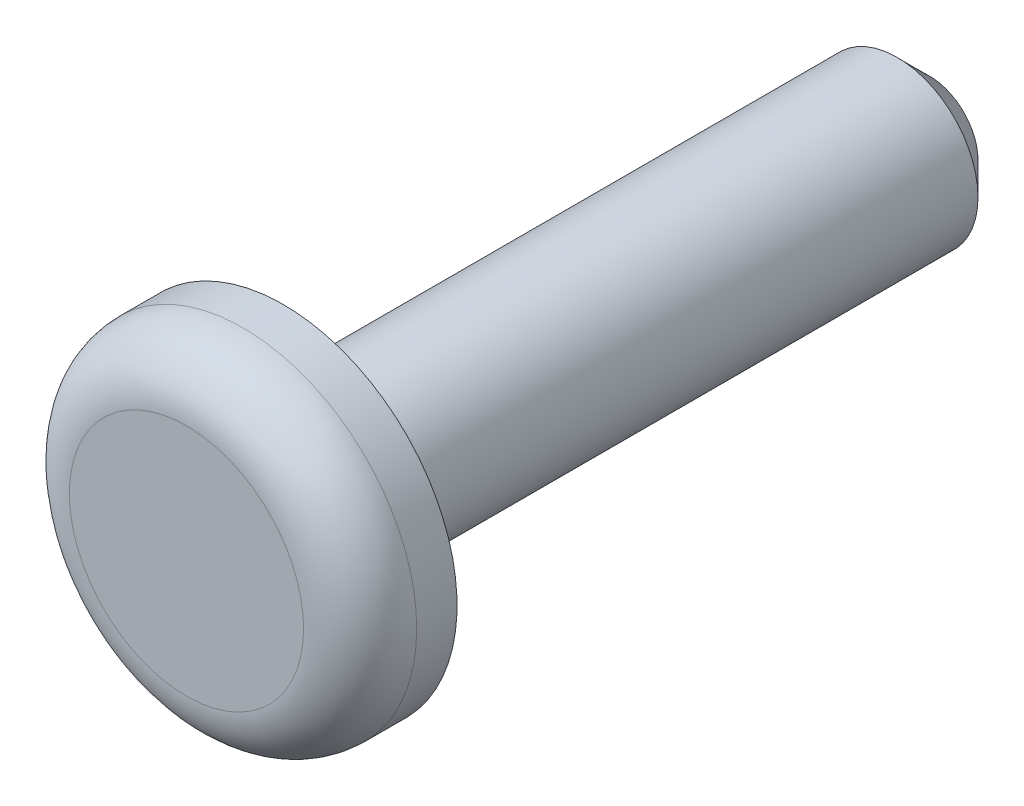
ISO-10303-21;
HEADER;
FILE_DESCRIPTION(('STEP AP214'),'2;1');
FILE_NAME('part.step','',(''),(''),'','','');
FILE_SCHEMA(('AUTOMOTIVE_DESIGN { 1 0 10303 214 1 1 1 1 }'));
ENDSEC;
DATA;
#1=APPLICATION_CONTEXT('core data for automotive mechanical design processes');
#2=APPLICATION_PROTOCOL_DEFINITION('international standard','automotive_design',2000,#1);
#3=PRODUCT_CONTEXT('',#1,'mechanical');
#4=PRODUCT('Part','Part','',(#3));
#5=PRODUCT_RELATED_PRODUCT_CATEGORY('part','',(#4));
#6=PRODUCT_DEFINITION_FORMATION('','',#4);
#7=PRODUCT_DEFINITION_CONTEXT('part definition',#1,'design');
#8=PRODUCT_DEFINITION('design','',#6,#7);
#9=PRODUCT_DEFINITION_SHAPE('','',#8);
#10=(LENGTH_UNIT() NAMED_UNIT(*) SI_UNIT(.MILLI.,.METRE.));
#11=(NAMED_UNIT(*) PLANE_ANGLE_UNIT() SI_UNIT($,.RADIAN.));
#12=(NAMED_UNIT(*) SI_UNIT($,.STERADIAN.) SOLID_ANGLE_UNIT());
#13=UNCERTAINTY_MEASURE_WITH_UNIT(LENGTH_MEASURE(1.E-05),#10,'distance_accuracy_value','');
#14=(GEOMETRIC_REPRESENTATION_CONTEXT(3) GLOBAL_UNCERTAINTY_ASSIGNED_CONTEXT((#13)) GLOBAL_UNIT_ASSIGNED_CONTEXT((#10,
#11,#12)) REPRESENTATION_CONTEXT('',''));
#15=CARTESIAN_POINT('',(0.,0.,0.));
#16=DIRECTION('',(0.,0.,1.));
#17=DIRECTION('',(1.,0.,0.));
#18=AXIS2_PLACEMENT_3D('',#15,#16,#17);
#19=CARTESIAN_POINT('',(0.,0.,1.2));
#20=DIRECTION('',(0.,0.,1.));
#21=DIRECTION('',(1.,0.,0.));
#22=AXIS2_PLACEMENT_3D('',#19,#20,#21);
#23=PLANE('',#22);
#24=CARTESIAN_POINT('',(0.,0.,1.2));
#25=DIRECTION('',(0.,0.,-1.));
#26=DIRECTION('',(1.,0.,0.));
#27=AXIS2_PLACEMENT_3D('',#24,#25,#26);
#28=CIRCLE('',#27,1.45);
#29=CARTESIAN_POINT('',(1.45,0.,1.2));
#30=VERTEX_POINT('',#29);
#31=EDGE_CURVE('E42',#30,#30,#28,.T.);
#32=ORIENTED_EDGE('',*,*,#31,.F.);
#33=EDGE_LOOP('',(#32));
#34=FACE_BOUND('',#33,.T.);
#35=ADVANCED_FACE('F15',(#34),#23,.T.);
#36=CARTESIAN_POINT('',(0.,0.,0.5));
#37=DIRECTION('',(0.,0.,1.));
#38=DIRECTION('',(1.,0.,0.));
#39=AXIS2_PLACEMENT_3D('',#36,#37,#38);
#40=TOROIDAL_SURFACE('',#39,1.45,0.7);
#41=ORIENTED_EDGE('',*,*,#31,.T.);
#42=EDGE_LOOP('',(#41));
#43=FACE_BOUND('',#42,.T.);
#44=CARTESIAN_POINT('',(0.,0.,0.5));
#45=DIRECTION('',(0.,0.,-1.));
#46=DIRECTION('',(-1.,0.,0.));
#47=AXIS2_PLACEMENT_3D('',#44,#45,#46);
#48=CIRCLE('',#47,2.15);
#49=CARTESIAN_POINT('',(-2.15,0.,0.5));
#50=VERTEX_POINT('',#49);
#51=EDGE_CURVE('E38',#50,#50,#48,.T.);
#52=ORIENTED_EDGE('',*,*,#51,.F.);
#53=EDGE_LOOP('',(#52));
#54=FACE_BOUND('',#53,.T.);
#55=ADVANCED_FACE('F56',(#43,#54),#40,.T.);
#56=CARTESIAN_POINT('',(0.,0.,-8.));
#57=DIRECTION('',(0.,0.,1.));
#58=DIRECTION('',(1.,0.,0.));
#59=AXIS2_PLACEMENT_3D('',#56,#57,#58);
#60=PLANE('',#59);
#61=CARTESIAN_POINT('',(0.,0.,-7.99999999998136));
#62=DIRECTION('',(0.,0.,1.));
#63=DIRECTION('',(1.,0.,0.));
#64=AXIS2_PLACEMENT_3D('',#61,#62,#63);
#65=CIRCLE('',#64,0.600000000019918);
#66=CARTESIAN_POINT('',(0.600000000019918,0.,-7.99999999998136));
#67=VERTEX_POINT('',#66);
#68=EDGE_CURVE('E19',#67,#67,#65,.T.);
#69=ORIENTED_EDGE('',*,*,#68,.F.);
#70=EDGE_LOOP('',(#69));
#71=FACE_BOUND('',#70,.T.);
#72=ADVANCED_FACE('F60',(#71),#60,.F.);
#73=CARTESIAN_POINT('',(0.,0.,1.2));
#74=DIRECTION('',(0.,0.,-1.));
#75=DIRECTION('',(-1.,0.,0.));
#76=AXIS2_PLACEMENT_3D('',#73,#74,#75);
#77=CYLINDRICAL_SURFACE('',#76,2.15);
#78=CARTESIAN_POINT('',(0.,0.,0.));
#79=DIRECTION('',(0.,0.,-1.));
#80=DIRECTION('',(-1.,0.,0.));
#81=AXIS2_PLACEMENT_3D('',#78,#79,#80);
#82=CIRCLE('',#81,2.15);
#83=CARTESIAN_POINT('',(-2.15,0.,0.));
#84=VERTEX_POINT('',#83);
#85=EDGE_CURVE('E28',#84,#84,#82,.F.);
#86=ORIENTED_EDGE('',*,*,#85,.T.);
#87=EDGE_LOOP('',(#86));
#88=FACE_BOUND('',#87,.T.);
#89=ORIENTED_EDGE('',*,*,#51,.T.);
#90=EDGE_LOOP('',(#89));
#91=FACE_BOUND('',#90,.T.);
#92=ADVANCED_FACE('F64',(#88,#91),#77,.T.);
#93=CARTESIAN_POINT('',(0.,0.,-7.59999999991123));
#94=DIRECTION('',(0.,0.,1.));
#95=DIRECTION('',(1.,0.,0.));
#96=AXIS2_PLACEMENT_3D('',#93,#94,#95);
#97=CONICAL_SURFACE('',#96,1.00000000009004,0.785398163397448);
#98=CARTESIAN_POINT('',(0.,0.,-7.6));
#99=DIRECTION('',(0.,0.,1.));
#100=DIRECTION('',(1.,0.,0.));
#101=AXIS2_PLACEMENT_3D('',#98,#99,#100);
#102=CIRCLE('',#101,1.);
#103=CARTESIAN_POINT('',(1.,0.,-7.6));
#104=VERTEX_POINT('',#103);
#105=EDGE_CURVE('E23',#104,#104,#102,.T.);
#106=ORIENTED_EDGE('',*,*,#105,.F.);
#107=EDGE_LOOP('',(#106));
#108=FACE_BOUND('',#107,.T.);
#109=ORIENTED_EDGE('',*,*,#68,.T.);
#110=EDGE_LOOP('',(#109));
#111=FACE_BOUND('',#110,.T.);
#112=ADVANCED_FACE('F68',(#108,#111),#97,.T.);
#113=CARTESIAN_POINT('',(0.,0.,0.));
#114=DIRECTION('',(0.,0.,1.));
#115=DIRECTION('',(1.,0.,0.));
#116=AXIS2_PLACEMENT_3D('',#113,#114,#115);
#117=PLANE('',#116);
#118=ORIENTED_EDGE('',*,*,#85,.F.);
#119=EDGE_LOOP('',(#118));
#120=FACE_BOUND('',#119,.T.);
#121=CARTESIAN_POINT('',(0.,0.,0.));
#122=DIRECTION('',(0.,0.,1.));
#123=DIRECTION('',(1.,0.,0.));
#124=AXIS2_PLACEMENT_3D('',#121,#122,#123);
#125=CIRCLE('',#124,1.);
#126=CARTESIAN_POINT('',(1.,0.,0.));
#127=VERTEX_POINT('',#126);
#128=EDGE_CURVE('E10',#127,#127,#125,.F.);
#129=ORIENTED_EDGE('',*,*,#128,.F.);
#130=EDGE_LOOP('',(#129));
#131=FACE_BOUND('',#130,.T.);
#132=ADVANCED_FACE('F71',(#120,#131),#117,.F.);
#133=CARTESIAN_POINT('',(0.,0.,-8.));
#134=DIRECTION('',(0.,0.,1.));
#135=DIRECTION('',(1.,0.,0.));
#136=AXIS2_PLACEMENT_3D('',#133,#134,#135);
#137=CYLINDRICAL_SURFACE('',#136,1.);
#138=ORIENTED_EDGE('',*,*,#128,.T.);
#139=EDGE_LOOP('',(#138));
#140=FACE_BOUND('',#139,.T.);
#141=ORIENTED_EDGE('',*,*,#105,.T.);
#142=EDGE_LOOP('',(#141));
#143=FACE_BOUND('',#142,.T.);
#144=ADVANCED_FACE('F75',(#140,#143),#137,.T.);
#145=CLOSED_SHELL('',(#35,#55,#72,#92,#112,#132,#144));
#146=MANIFOLD_SOLID_BREP('B1',#145);
#147=ADVANCED_BREP_SHAPE_REPRESENTATION('',(#18,#146),#14);
#148=SHAPE_DEFINITION_REPRESENTATION(#9,#147);
ENDSEC;
END-ISO-10303-21;
